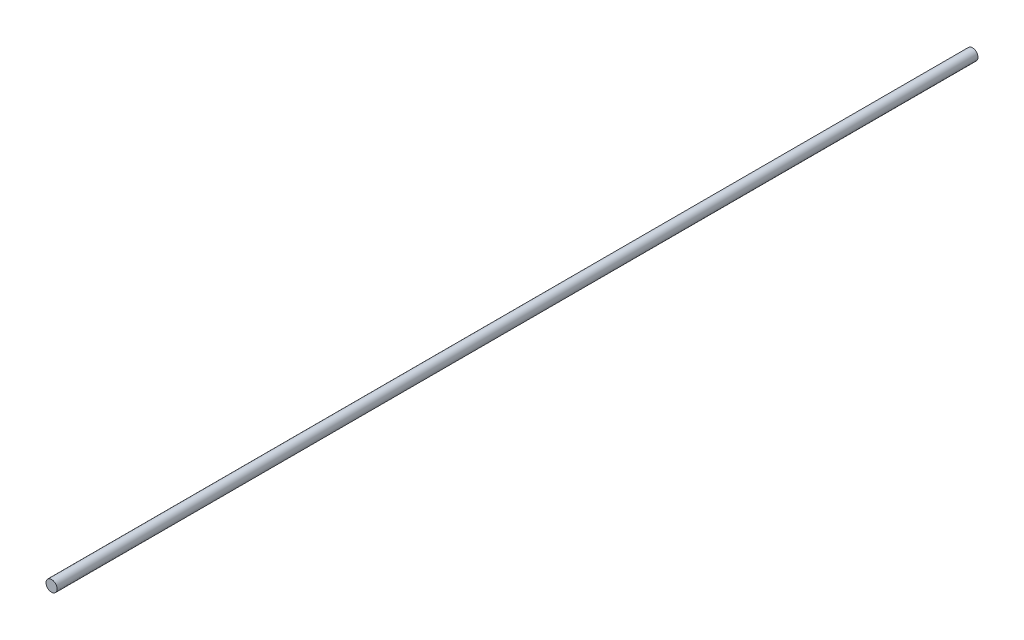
ISO-10303-21;
HEADER;
FILE_DESCRIPTION(('STEP AP214'),'2;1');
FILE_NAME('part.step','',(''),(''),'','','');
FILE_SCHEMA(('AUTOMOTIVE_DESIGN { 1 0 10303 214 1 1 1 1 }'));
ENDSEC;
DATA;
#1=APPLICATION_CONTEXT('core data for automotive mechanical design processes');
#2=APPLICATION_PROTOCOL_DEFINITION('international standard','automotive_design',2000,#1);
#3=PRODUCT_CONTEXT('',#1,'mechanical');
#4=PRODUCT('Part','Part','',(#3));
#5=PRODUCT_RELATED_PRODUCT_CATEGORY('part','',(#4));
#6=PRODUCT_DEFINITION_FORMATION('','',#4);
#7=PRODUCT_DEFINITION_CONTEXT('part definition',#1,'design');
#8=PRODUCT_DEFINITION('design','',#6,#7);
#9=PRODUCT_DEFINITION_SHAPE('','',#8);
#10=(LENGTH_UNIT() NAMED_UNIT(*) SI_UNIT(.MILLI.,.METRE.));
#11=(NAMED_UNIT(*) PLANE_ANGLE_UNIT() SI_UNIT($,.RADIAN.));
#12=(NAMED_UNIT(*) SI_UNIT($,.STERADIAN.) SOLID_ANGLE_UNIT());
#13=UNCERTAINTY_MEASURE_WITH_UNIT(LENGTH_MEASURE(1.E-05),#10,'distance_accuracy_value','');
#14=(GEOMETRIC_REPRESENTATION_CONTEXT(3) GLOBAL_UNCERTAINTY_ASSIGNED_CONTEXT((#13)) GLOBAL_UNIT_ASSIGNED_CONTEXT((#10,
#11,#12)) REPRESENTATION_CONTEXT('',''));
#15=CARTESIAN_POINT('',(0.,0.,0.));
#16=DIRECTION('',(0.,0.,1.));
#17=DIRECTION('',(1.,0.,0.));
#18=AXIS2_PLACEMENT_3D('',#15,#16,#17);
#19=CARTESIAN_POINT('',(0.,0.,1054.1));
#20=DIRECTION('',(0.,0.,-1.));
#21=DIRECTION('',(-1.,0.,0.));
#22=AXIS2_PLACEMENT_3D('',#19,#20,#21);
#23=CYLINDRICAL_SURFACE('',#22,6.35);
#24=CARTESIAN_POINT('',(0.,0.,1054.1));
#25=DIRECTION('',(0.,0.,1.));
#26=DIRECTION('',(1.,0.,0.));
#27=AXIS2_PLACEMENT_3D('',#24,#25,#26);
#28=CIRCLE('',#27,6.35);
#29=CARTESIAN_POINT('',(6.35,0.,1054.1));
#30=VERTEX_POINT('',#29);
#31=EDGE_CURVE('E10',#30,#30,#28,.T.);
#32=ORIENTED_EDGE('',*,*,#31,.F.);
#33=EDGE_LOOP('',(#32));
#34=FACE_BOUND('',#33,.T.);
#35=CARTESIAN_POINT('',(0.,0.,0.));
#36=DIRECTION('',(0.,0.,1.));
#37=DIRECTION('',(1.,0.,0.));
#38=AXIS2_PLACEMENT_3D('',#35,#36,#37);
#39=CIRCLE('',#38,6.35);
#40=CARTESIAN_POINT('',(6.35,0.,0.));
#41=VERTEX_POINT('',#40);
#42=EDGE_CURVE('E33',#41,#41,#39,.T.);
#43=ORIENTED_EDGE('',*,*,#42,.T.);
#44=EDGE_LOOP('',(#43));
#45=FACE_BOUND('',#44,.T.);
#46=ADVANCED_FACE('F30',(#34,#45),#23,.T.);
#47=CARTESIAN_POINT('',(0.,0.,1054.1));
#48=DIRECTION('',(0.,0.,1.));
#49=DIRECTION('',(1.,0.,0.));
#50=AXIS2_PLACEMENT_3D('',#47,#48,#49);
#51=PLANE('',#50);
#52=ORIENTED_EDGE('',*,*,#31,.T.);
#53=EDGE_LOOP('',(#52));
#54=FACE_BOUND('',#53,.T.);
#55=ADVANCED_FACE('F45',(#54),#51,.T.);
#56=CARTESIAN_POINT('',(0.,0.,0.));
#57=DIRECTION('',(0.,0.,1.));
#58=DIRECTION('',(1.,0.,0.));
#59=AXIS2_PLACEMENT_3D('',#56,#57,#58);
#60=PLANE('',#59);
#61=ORIENTED_EDGE('',*,*,#42,.F.);
#62=EDGE_LOOP('',(#61));
#63=FACE_BOUND('',#62,.T.);
#64=ADVANCED_FACE('F43',(#63),#60,.F.);
#65=CLOSED_SHELL('',(#46,#55,#64));
#66=MANIFOLD_SOLID_BREP('B2',#65);
#67=ADVANCED_BREP_SHAPE_REPRESENTATION('',(#18,#66),#14);
#68=SHAPE_DEFINITION_REPRESENTATION(#9,#67);
ENDSEC;
END-ISO-10303-21;
